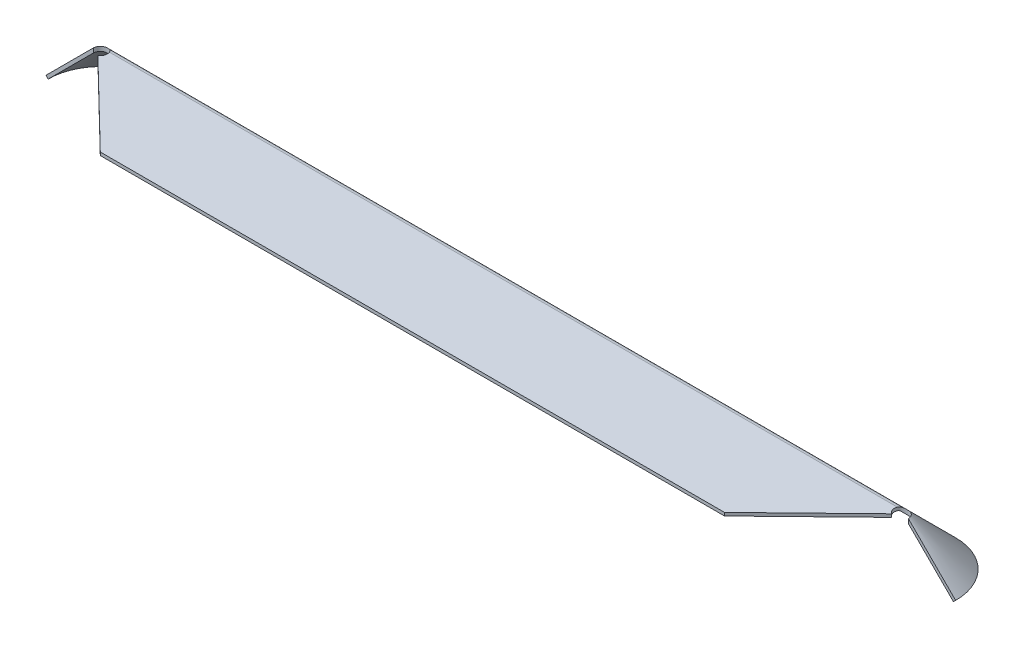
ISO-10303-21;
HEADER;
FILE_DESCRIPTION(('STEP AP214'),'2;1');
FILE_NAME('part.step','',(''),(''),'','','');
FILE_SCHEMA(('AUTOMOTIVE_DESIGN { 1 0 10303 214 1 1 1 1 }'));
ENDSEC;
DATA;
#1=APPLICATION_CONTEXT('core data for automotive mechanical design processes');
#2=APPLICATION_PROTOCOL_DEFINITION('international standard','automotive_design',2000,#1);
#3=PRODUCT_CONTEXT('',#1,'mechanical');
#4=PRODUCT('Part','Part','',(#3));
#5=PRODUCT_RELATED_PRODUCT_CATEGORY('part','',(#4));
#6=PRODUCT_DEFINITION_FORMATION('','',#4);
#7=PRODUCT_DEFINITION_CONTEXT('part definition',#1,'design');
#8=PRODUCT_DEFINITION('design','',#6,#7);
#9=PRODUCT_DEFINITION_SHAPE('','',#8);
#10=(LENGTH_UNIT() NAMED_UNIT(*) SI_UNIT(.MILLI.,.METRE.));
#11=(NAMED_UNIT(*) PLANE_ANGLE_UNIT() SI_UNIT($,.RADIAN.));
#12=(NAMED_UNIT(*) SI_UNIT($,.STERADIAN.) SOLID_ANGLE_UNIT());
#13=UNCERTAINTY_MEASURE_WITH_UNIT(LENGTH_MEASURE(1.E-05),#10,'distance_accuracy_value','');
#14=(GEOMETRIC_REPRESENTATION_CONTEXT(3) GLOBAL_UNCERTAINTY_ASSIGNED_CONTEXT((#13)) GLOBAL_UNIT_ASSIGNED_CONTEXT((#10,
#11,#12)) REPRESENTATION_CONTEXT('',''));
#15=CARTESIAN_POINT('',(0.,0.,0.));
#16=DIRECTION('',(0.,0.,1.));
#17=DIRECTION('',(1.,0.,0.));
#18=AXIS2_PLACEMENT_3D('',#15,#16,#17);
#19=CARTESIAN_POINT('',(-154.,-1.2,-34.));
#20=DIRECTION('',(0.,1.,0.));
#21=DIRECTION('',(0.,0.,1.));
#22=AXIS2_PLACEMENT_3D('',#19,#20,#21);
#23=PLANE('',#22);
#24=CARTESIAN_POINT('',(154.,-1.19999999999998,-34.));
#25=DIRECTION('',(0.,1.,0.));
#26=DIRECTION('',(0.,0.,1.));
#27=AXIS2_PLACEMENT_3D('',#24,#25,#26);
#28=CIRCLE('',#27,2.69705627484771);
#29=CARTESIAN_POINT('',(151.49518213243,-1.2,-35.));
#30=VERTEX_POINT('',#29);
#31=CARTESIAN_POINT('',(152.616642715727,-1.19999999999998,-31.684738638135));
#32=VERTEX_POINT('',#31);
#33=EDGE_CURVE('E173',#30,#32,#28,.T.);
#34=ORIENTED_EDGE('',*,*,#33,.T.);
#35=DIRECTION('',(-0.717279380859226,0.,0.696785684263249));
#36=VECTOR('',#35,1.);
#37=CARTESIAN_POINT('',(-3.97732045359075,-1.2,120.435111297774));
#38=LINE('',#37,#36);
#39=CARTESIAN_POINT('',(120.,-1.19999999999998,0.));
#40=VERTEX_POINT('',#39);
#41=EDGE_CURVE('E175',#32,#40,#38,.T.);
#42=ORIENTED_EDGE('',*,*,#41,.T.);
#43=DIRECTION('',(1.,0.,0.));
#44=VECTOR('',#43,1.);
#45=CARTESIAN_POINT('',(0.,-1.2,0.));
#46=LINE('',#45,#44);
#47=CARTESIAN_POINT('',(-120.,-1.2,0.));
#48=VERTEX_POINT('',#47);
#49=EDGE_CURVE('E273',#48,#40,#46,.T.);
#50=ORIENTED_EDGE('',*,*,#49,.F.);
#51=DIRECTION('',(0.717279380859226,0.,0.696785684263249));
#52=VECTOR('',#51,1.);
#53=CARTESIAN_POINT('',(-154.485510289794,-1.2,-33.5002099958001));
#54=LINE('',#53,#52);
#55=CARTESIAN_POINT('',(-152.616642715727,-1.19999999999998,-31.684738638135));
#56=VERTEX_POINT('',#55);
#57=EDGE_CURVE('E55',#56,#48,#54,.T.);
#58=ORIENTED_EDGE('',*,*,#57,.F.);
#59=CARTESIAN_POINT('',(-154.,-1.19999999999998,-34.));
#60=DIRECTION('',(0.,1.,0.));
#61=DIRECTION('',(0.,0.,1.));
#62=AXIS2_PLACEMENT_3D('',#59,#60,#61);
#63=CIRCLE('',#62,2.69705627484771);
#64=CARTESIAN_POINT('',(-151.495182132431,-1.2,-35.));
#65=VERTEX_POINT('',#64);
#66=EDGE_CURVE('E226',#65,#56,#63,.F.);
#67=ORIENTED_EDGE('',*,*,#66,.F.);
#68=DIRECTION('',(-1.,0.,0.));
#69=VECTOR('',#68,1.);
#70=CARTESIAN_POINT('',(154.,-1.2,-35.));
#71=LINE('',#70,#69);
#72=EDGE_CURVE('E279',#30,#65,#71,.T.);
#73=ORIENTED_EDGE('',*,*,#72,.F.);
#74=EDGE_LOOP('',(#34,#42,#50,#58,#67,#73));
#75=FACE_BOUND('',#74,.T.);
#76=ADVANCED_FACE('F40',(#75),#23,.F.);
#77=CARTESIAN_POINT('',(-154.,0.,-34.));
#78=DIRECTION('',(0.,1.,0.));
#79=DIRECTION('',(0.,0.,1.));
#80=AXIS2_PLACEMENT_3D('',#77,#78,#79);
#81=PLANE('',#80);
#82=DIRECTION('',(-0.717279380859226,0.,0.696785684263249));
#83=VECTOR('',#82,1.);
#84=CARTESIAN_POINT('',(-3.97732045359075,0.,120.435111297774));
#85=LINE('',#84,#83);
#86=CARTESIAN_POINT('',(152.616642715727,0.,-31.684738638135));
#87=VERTEX_POINT('',#86);
#88=CARTESIAN_POINT('',(120.,0.,0.));
#89=VERTEX_POINT('',#88);
#90=EDGE_CURVE('E172',#87,#89,#85,.T.);
#91=ORIENTED_EDGE('',*,*,#90,.F.);
#92=CARTESIAN_POINT('',(154.,0.,-34.));
#93=DIRECTION('',(0.,1.,0.));
#94=DIRECTION('',(0.,0.,1.));
#95=AXIS2_PLACEMENT_3D('',#92,#93,#94);
#96=CIRCLE('',#95,2.69705627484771);
#97=CARTESIAN_POINT('',(151.49518213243,0.,-35.));
#98=VERTEX_POINT('',#97);
#99=EDGE_CURVE('E157',#98,#87,#96,.T.);
#100=ORIENTED_EDGE('',*,*,#99,.F.);
#101=DIRECTION('',(-1.,0.,0.));
#102=VECTOR('',#101,1.);
#103=CARTESIAN_POINT('',(154.,0.,-35.));
#104=LINE('',#103,#102);
#105=CARTESIAN_POINT('',(-151.495182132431,0.,-35.));
#106=VERTEX_POINT('',#105);
#107=EDGE_CURVE('E270',#98,#106,#104,.T.);
#108=ORIENTED_EDGE('',*,*,#107,.T.);
#109=CARTESIAN_POINT('',(-154.,0.,-34.));
#110=DIRECTION('',(0.,1.,0.));
#111=DIRECTION('',(0.,0.,1.));
#112=AXIS2_PLACEMENT_3D('',#109,#110,#111);
#113=CIRCLE('',#112,2.69705627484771);
#114=CARTESIAN_POINT('',(-152.616642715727,0.,-31.684738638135));
#115=VERTEX_POINT('',#114);
#116=EDGE_CURVE('E62',#106,#115,#113,.F.);
#117=ORIENTED_EDGE('',*,*,#116,.T.);
#118=DIRECTION('',(0.717279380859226,0.,0.696785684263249));
#119=VECTOR('',#118,1.);
#120=CARTESIAN_POINT('',(-154.485510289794,0.,-33.5002099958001));
#121=LINE('',#120,#119);
#122=CARTESIAN_POINT('',(-120.,0.,0.));
#123=VERTEX_POINT('',#122);
#124=EDGE_CURVE('E12',#115,#123,#121,.T.);
#125=ORIENTED_EDGE('',*,*,#124,.T.);
#126=DIRECTION('',(1.,0.,0.));
#127=VECTOR('',#126,1.);
#128=CARTESIAN_POINT('',(0.,0.,0.));
#129=LINE('',#128,#127);
#130=EDGE_CURVE('E267',#123,#89,#129,.T.);
#131=ORIENTED_EDGE('',*,*,#130,.T.);
#132=EDGE_LOOP('',(#91,#100,#108,#117,#125,#131));
#133=FACE_BOUND('',#132,.T.);
#134=ADVANCED_FACE('F265',(#133),#81,.T.);
#135=CARTESIAN_POINT('',(-154.,-0.848528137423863,-35.1455844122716));
#136=DIRECTION('',(0.,-0.707106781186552,0.707106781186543));
#137=DIRECTION('',(0.,-0.707106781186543,-0.707106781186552));
#138=AXIS2_PLACEMENT_3D('',#135,#136,#137);
#139=PLANE('',#138);
#140=CARTESIAN_POINT('',(154.,0.297056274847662,-34.));
#141=DIRECTION('',(0.,-0.707106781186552,0.707106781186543));
#142=DIRECTION('',(0.,-0.707106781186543,-0.707106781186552));
#143=AXIS2_PLACEMENT_3D('',#140,#141,#142);
#144=ELLIPSE('',#143,3.81421356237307,2.69705627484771);
#145=CARTESIAN_POINT('',(152.036061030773,-1.55147186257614,-35.8485281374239));
#146=VERTEX_POINT('',#145);
#147=CARTESIAN_POINT('',(154.,-2.39999999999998,-36.6970562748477));
#148=VERTEX_POINT('',#147);
#149=EDGE_CURVE('E153',#146,#148,#144,.T.);
#150=ORIENTED_EDGE('',*,*,#149,.F.);
#151=DIRECTION('',(1.,0.,0.));
#152=VECTOR('',#151,1.);
#153=CARTESIAN_POINT('',(-154.,-1.55147186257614,-35.8485281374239));
#154=LINE('',#153,#152);
#155=CARTESIAN_POINT('',(-152.036061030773,-1.55147186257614,-35.8485281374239));
#156=VERTEX_POINT('',#155);
#157=EDGE_CURVE('E325',#156,#146,#154,.T.);
#158=ORIENTED_EDGE('',*,*,#157,.F.);
#159=CARTESIAN_POINT('',(-154.,0.297056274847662,-34.));
#160=DIRECTION('',(0.,-0.707106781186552,0.707106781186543));
#161=DIRECTION('',(0.,-0.707106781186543,-0.707106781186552));
#162=AXIS2_PLACEMENT_3D('',#159,#160,#161);
#163=ELLIPSE('',#162,3.81421356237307,2.69705627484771);
#164=CARTESIAN_POINT('',(-154.,-2.39999999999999,-36.6970562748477));
#165=VERTEX_POINT('',#164);
#166=EDGE_CURVE('E227',#156,#165,#163,.F.);
#167=ORIENTED_EDGE('',*,*,#166,.T.);
#168=DIRECTION('',(0.,-0.707106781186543,-0.707106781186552));
#169=VECTOR('',#168,1.);
#170=CARTESIAN_POINT('',(-154.,-0.848528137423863,-35.1455844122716));
#171=LINE('',#170,#169);
#172=CARTESIAN_POINT('',(-154.,-19.7261976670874,-54.0232539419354));
#173=VERTEX_POINT('',#172);
#174=EDGE_CURVE('E298',#165,#173,#171,.T.);
#175=ORIENTED_EDGE('',*,*,#174,.T.);
#176=DIRECTION('',(1.,0.,0.));
#177=VECTOR('',#176,1.);
#178=CARTESIAN_POINT('',(-154.,-19.7261976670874,-54.0232539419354));
#179=LINE('',#178,#177);
#180=CARTESIAN_POINT('',(154.,-19.7261976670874,-54.0232539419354));
#181=VERTEX_POINT('',#180);
#182=EDGE_CURVE('E326',#173,#181,#179,.T.);
#183=ORIENTED_EDGE('',*,*,#182,.T.);
#184=DIRECTION('',(0.,-0.707106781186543,-0.707106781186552));
#185=VECTOR('',#184,1.);
#186=CARTESIAN_POINT('',(154.,-1.55147186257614,-35.8485281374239));
#187=LINE('',#186,#185);
#188=EDGE_CURVE('E329',#148,#181,#187,.T.);
#189=ORIENTED_EDGE('',*,*,#188,.F.);
#190=EDGE_LOOP('',(#150,#158,#167,#175,#183,#189));
#191=FACE_BOUND('',#190,.T.);
#192=ADVANCED_FACE('F234',(#191),#139,.T.);
#193=CARTESIAN_POINT('',(-154.,-2.4,-35.));
#194=DIRECTION('',(1.,0.,0.));
#195=DIRECTION('',(0.,0.,-1.));
#196=AXIS2_PLACEMENT_3D('',#193,#194,#195);
#197=CYLINDRICAL_SURFACE('',#196,1.2);
#198=CARTESIAN_POINT('',(151.49518213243,-1.2,-35.));
#199=CARTESIAN_POINT('',(151.509818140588,-1.19999967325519,-35.0366733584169));
#200=CARTESIAN_POINT('',(151.525256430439,-1.20168121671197,-35.0729900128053));
#201=CARTESIAN_POINT('',(151.557573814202,-1.20820658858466,-35.1446420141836));
#202=CARTESIAN_POINT('',(151.574451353,-1.21304704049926,-35.1799783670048));
#203=CARTESIAN_POINT('',(151.626852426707,-1.23194063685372,-35.2838461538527));
#204=CARTESIAN_POINT('',(151.664310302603,-1.25037062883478,-35.3506485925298));
#205=CARTESIAN_POINT('',(151.742678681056,-1.29718548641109,-35.4779022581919));
#206=CARTESIAN_POINT('',(151.783573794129,-1.32552760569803,-35.5383793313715));
#207=CARTESIAN_POINT('',(151.86754067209,-1.39094543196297,-35.6528030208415));
#208=CARTESIAN_POINT('',(151.910613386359,-1.42802497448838,-35.7067467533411));
#209=CARTESIAN_POINT('',(151.967610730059,-1.48200821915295,-35.773119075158));
#210=CARTESIAN_POINT('',(151.981327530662,-1.49537119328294,-35.7887133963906));
#211=CARTESIAN_POINT('',(152.008725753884,-1.52285130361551,-35.8191637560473));
#212=CARTESIAN_POINT('',(152.022407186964,-1.5369666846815,-35.8340213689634));
#213=CARTESIAN_POINT('',(152.036061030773,-1.55147186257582,-35.848528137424));
#214=B_SPLINE_CURVE_WITH_KNOTS('',3,(#198,#199,#200,#201,#202,#203,#204,#205,#206,#207,#208,
#209,#210,#211,#212,#213),.UNSPECIFIED.,.F.,.F.,(4,2,2,2,2,2,2,4),(0.,0.118354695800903,
0.236583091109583,0.47172552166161,0.705866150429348,0.940109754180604,1.01418352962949,
1.0880914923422),.UNSPECIFIED.);
#215=EDGE_CURVE('E178',#30,#146,#214,.T.);
#216=ORIENTED_EDGE('',*,*,#215,.F.);
#217=ORIENTED_EDGE('',*,*,#72,.T.);
#218=CARTESIAN_POINT('',(-151.495182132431,-1.2,-35.));
#219=CARTESIAN_POINT('',(-151.509818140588,-1.19999967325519,-35.0366733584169));
#220=CARTESIAN_POINT('',(-151.525256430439,-1.20168121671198,-35.0729900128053));
#221=CARTESIAN_POINT('',(-151.557573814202,-1.20820658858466,-35.1446420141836));
#222=CARTESIAN_POINT('',(-151.574451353,-1.21304704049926,-35.1799783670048));
#223=CARTESIAN_POINT('',(-151.626852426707,-1.23194063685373,-35.2838461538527));
#224=CARTESIAN_POINT('',(-151.664310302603,-1.25037062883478,-35.3506485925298));
#225=CARTESIAN_POINT('',(-151.742678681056,-1.2971854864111,-35.4779022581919));
#226=CARTESIAN_POINT('',(-151.783573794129,-1.32552760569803,-35.5383793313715));
#227=CARTESIAN_POINT('',(-151.86754067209,-1.39094543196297,-35.6528030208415));
#228=CARTESIAN_POINT('',(-151.910613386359,-1.42802497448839,-35.7067467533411));
#229=CARTESIAN_POINT('',(-151.967610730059,-1.48200821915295,-35.773119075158));
#230=CARTESIAN_POINT('',(-151.981327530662,-1.49537119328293,-35.7887133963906));
#231=CARTESIAN_POINT('',(-152.008725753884,-1.5228513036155,-35.8191637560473));
#232=CARTESIAN_POINT('',(-152.022407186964,-1.53696668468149,-35.8340213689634));
#233=CARTESIAN_POINT('',(-152.036061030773,-1.55147186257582,-35.848528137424));
#234=B_SPLINE_CURVE_WITH_KNOTS('',3,(#218,#219,#220,#221,#222,#223,#224,#225,#226,#227,#228,
#229,#230,#231,#232,#233),.UNSPECIFIED.,.F.,.F.,(4,2,2,2,2,2,2,4),(0.,0.118354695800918,
0.23658309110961,0.471725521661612,0.705866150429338,0.940109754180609,1.01418352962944,
1.0880914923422),.UNSPECIFIED.);
#235=EDGE_CURVE('E218',#65,#156,#234,.T.);
#236=ORIENTED_EDGE('',*,*,#235,.T.);
#237=ORIENTED_EDGE('',*,*,#157,.T.);
#238=EDGE_LOOP('',(#216,#217,#236,#237));
#239=FACE_BOUND('',#238,.T.);
#240=ADVANCED_FACE('F229',(#239),#197,.F.);
#241=CARTESIAN_POINT('',(-154.,-1.55147186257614,-34.));
#242=DIRECTION('',(0.,-1.,0.));
#243=DIRECTION('',(0.,0.,-1.));
#244=AXIS2_PLACEMENT_3D('',#241,#242,#243);
#245=CONICAL_SURFACE('',#244,1.84852813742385,0.785398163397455);
#246=ORIENTED_EDGE('',*,*,#174,.F.);
#247=CARTESIAN_POINT('',(-154.,-2.39999999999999,-34.));
#248=DIRECTION('',(0.,-1.,0.));
#249=DIRECTION('',(0.,0.,-1.));
#250=AXIS2_PLACEMENT_3D('',#247,#248,#249);
#251=CIRCLE('',#250,2.69705627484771);
#252=CARTESIAN_POINT('',(-156.697056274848,-2.39999999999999,-34.));
#253=VERTEX_POINT('',#252);
#254=EDGE_CURVE('E387',#165,#253,#251,.F.);
#255=ORIENTED_EDGE('',*,*,#254,.T.);
#256=DIRECTION('',(-0.707106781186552,-0.707106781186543,0.));
#257=VECTOR('',#256,1.);
#258=CARTESIAN_POINT('',(-155.145584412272,-0.848528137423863,-34.));
#259=LINE('',#258,#257);
#260=CARTESIAN_POINT('',(-174.023253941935,-19.7261976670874,-34.));
#261=VERTEX_POINT('',#260);
#262=EDGE_CURVE('E190',#253,#261,#259,.T.);
#263=ORIENTED_EDGE('',*,*,#262,.T.);
#264=CARTESIAN_POINT('',(-154.,-19.7261976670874,-34.));
#265=DIRECTION('',(0.,-1.,0.));
#266=DIRECTION('',(0.,0.,-1.));
#267=AXIS2_PLACEMENT_3D('',#264,#265,#266);
#268=CIRCLE('',#267,20.0232539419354);
#269=EDGE_CURVE('E322',#261,#173,#268,.T.);
#270=ORIENTED_EDGE('',*,*,#269,.T.);
#271=EDGE_LOOP('',(#246,#255,#263,#270));
#272=FACE_BOUND('',#271,.T.);
#273=ADVANCED_FACE('F233',(#272),#245,.F.);
#274=CARTESIAN_POINT('',(-154.,-2.4,-35.));
#275=DIRECTION('',(1.,0.,0.));
#276=DIRECTION('',(0.,0.,-1.));
#277=AXIS2_PLACEMENT_3D('',#274,#275,#276);
#278=CYLINDRICAL_SURFACE('',#277,2.4);
#279=ORIENTED_EDGE('',*,*,#107,.F.);
#280=CARTESIAN_POINT('',(151.49518213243,0.,-35.));
#281=CARTESIAN_POINT('',(151.519553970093,1.09403043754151E-05,-35.061088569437));
#282=CARTESIAN_POINT('',(151.546173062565,-0.00233142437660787,-35.1212362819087));
#283=CARTESIAN_POINT('',(151.603542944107,-0.0112130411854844,-35.2391017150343));
#284=CARTESIAN_POINT('',(151.634287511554,-0.0177460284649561,-35.2968229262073));
#285=CARTESIAN_POINT('',(151.699279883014,-0.0344148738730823,-35.4088853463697));
#286=CARTESIAN_POINT('',(151.733487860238,-0.0445124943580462,-35.4632554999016));
#287=CARTESIAN_POINT('',(151.805346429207,-0.0677918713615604,-35.5689797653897));
#288=CARTESIAN_POINT('',(151.842998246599,-0.0809747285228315,-35.6203327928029));
#289=CARTESIAN_POINT('',(151.960186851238,-0.124185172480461,-35.7689279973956));
#290=CARTESIAN_POINT('',(152.044395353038,-0.157999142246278,-35.8614541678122));
#291=CARTESIAN_POINT('',(152.223574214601,-0.231756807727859,-36.0332088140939));
#292=CARTESIAN_POINT('',(152.318590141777,-0.271726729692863,-36.1123772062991));
#293=CARTESIAN_POINT('',(152.53656601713,-0.361310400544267,-36.2701937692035));
#294=CARTESIAN_POINT('',(152.661437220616,-0.411335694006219,-36.3460096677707));
#295=CARTESIAN_POINT('',(152.857357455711,-0.48267832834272,-36.4441328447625));
#296=CARTESIAN_POINT('',(152.92397606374,-0.505806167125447,-36.4742015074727));
#297=CARTESIAN_POINT('',(153.060110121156,-0.549801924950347,-36.5290516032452));
#298=CARTESIAN_POINT('',(153.129625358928,-0.570670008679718,-36.5538334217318));
#299=CARTESIAN_POINT('',(153.263429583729,-0.606822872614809,-36.5953651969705));
#300=CARTESIAN_POINT('',(153.327437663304,-0.622470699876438,-36.612702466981));
#301=CARTESIAN_POINT('',(153.457270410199,-0.650179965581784,-36.6427247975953));
#302=CARTESIAN_POINT('',(153.523093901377,-0.662243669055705,-36.6554127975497));
#303=CARTESIAN_POINT('',(153.656939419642,-0.682094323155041,-36.6760133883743));
#304=CARTESIAN_POINT('',(153.724978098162,-0.689830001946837,-36.6838688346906));
#305=CARTESIAN_POINT('',(153.861995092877,-0.70029507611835,-36.6944077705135));
#306=CARTESIAN_POINT('',(153.930975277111,-0.703012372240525,-36.6970787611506));
#307=CARTESIAN_POINT('',(154.,-0.702943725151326,-36.6970562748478));
#308=B_SPLINE_CURVE_WITH_KNOTS('',3,(#280,#281,#282,#283,#284,#285,#286,#287,#288,#289,#290,
#291,#292,#293,#294,#295,#296,#297,#298,#299,#300,#301,#302,#303,#304,#305,#306,#307),
.UNSPECIFIED.,.F.,.F.,(4,2,2,2,2,2,2,2,2,2,2,2,2,4),(0.,0.197165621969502,0.39403717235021,
0.588858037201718,0.78374850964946,1.17093287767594,1.559814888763,2.02098484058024,
2.25076928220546,2.48053696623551,2.68469889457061,2.88873152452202,3.09513264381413,
3.30203074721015),.UNSPECIFIED.);
#309=CARTESIAN_POINT('',(154.,-0.702943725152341,-36.6970562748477));
#310=VERTEX_POINT('',#309);
#311=EDGE_CURVE('E249',#98,#310,#308,.T.);
#312=ORIENTED_EDGE('',*,*,#311,.T.);
#313=DIRECTION('',(1.,0.,0.));
#314=VECTOR('',#313,1.);
#315=CARTESIAN_POINT('',(-154.,-0.702943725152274,-36.6970562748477));
#316=LINE('',#315,#314);
#317=CARTESIAN_POINT('',(-154.,-0.702943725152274,-36.6970562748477));
#318=VERTEX_POINT('',#317);
#319=EDGE_CURVE('E307',#318,#310,#316,.T.);
#320=ORIENTED_EDGE('',*,*,#319,.F.);
#321=CARTESIAN_POINT('',(-151.495182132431,0.,-35.));
#322=CARTESIAN_POINT('',(-151.519553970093,1.0940304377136E-05,-35.061088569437));
#323=CARTESIAN_POINT('',(-151.546173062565,-0.00233142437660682,-35.1212362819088));
#324=CARTESIAN_POINT('',(-151.603542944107,-0.0112130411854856,-35.2391017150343));
#325=CARTESIAN_POINT('',(-151.634287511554,-0.0177460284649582,-35.2968229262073));
#326=CARTESIAN_POINT('',(-151.699279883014,-0.0344148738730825,-35.4088853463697));
#327=CARTESIAN_POINT('',(-151.733487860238,-0.0445124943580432,-35.4632554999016));
#328=CARTESIAN_POINT('',(-151.805346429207,-0.0677918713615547,-35.5689797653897));
#329=CARTESIAN_POINT('',(-151.842998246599,-0.0809747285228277,-35.6203327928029));
#330=CARTESIAN_POINT('',(-151.960186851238,-0.124185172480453,-35.7689279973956));
#331=CARTESIAN_POINT('',(-152.044395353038,-0.157999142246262,-35.8614541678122));
#332=CARTESIAN_POINT('',(-152.223574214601,-0.231756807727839,-36.0332088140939));
#333=CARTESIAN_POINT('',(-152.318590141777,-0.27172672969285,-36.1123772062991));
#334=CARTESIAN_POINT('',(-152.53656601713,-0.361310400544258,-36.2701937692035));
#335=CARTESIAN_POINT('',(-152.661437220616,-0.411335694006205,-36.3460096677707));
#336=CARTESIAN_POINT('',(-152.857357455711,-0.482678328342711,-36.4441328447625));
#337=CARTESIAN_POINT('',(-152.92397606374,-0.505806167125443,-36.4742015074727));
#338=CARTESIAN_POINT('',(-153.060110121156,-0.549801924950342,-36.5290516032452));
#339=CARTESIAN_POINT('',(-153.129625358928,-0.570670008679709,-36.5538334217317));
#340=CARTESIAN_POINT('',(-153.263429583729,-0.606822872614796,-36.5953651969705));
#341=CARTESIAN_POINT('',(-153.327437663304,-0.622470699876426,-36.612702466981));
#342=CARTESIAN_POINT('',(-153.457270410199,-0.650179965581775,-36.6427247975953));
#343=CARTESIAN_POINT('',(-153.523093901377,-0.662243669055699,-36.6554127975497));
#344=CARTESIAN_POINT('',(-153.656939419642,-0.682094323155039,-36.6760133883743));
#345=CARTESIAN_POINT('',(-153.724978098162,-0.689830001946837,-36.6838688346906));
#346=CARTESIAN_POINT('',(-153.861995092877,-0.700295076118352,-36.6944077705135));
#347=CARTESIAN_POINT('',(-153.930975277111,-0.703012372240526,-36.6970787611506));
#348=CARTESIAN_POINT('',(-154.,-0.702943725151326,-36.6970562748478));
#349=B_SPLINE_CURVE_WITH_KNOTS('',3,(#321,#322,#323,#324,#325,#326,#327,#328,#329,#330,#331,
#332,#333,#334,#335,#336,#337,#338,#339,#340,#341,#342,#343,#344,#345,#346,#347,#348),
.UNSPECIFIED.,.F.,.F.,(4,2,2,2,2,2,2,2,2,2,2,2,2,4),(0.,0.197165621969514,0.394037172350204,
0.588858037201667,0.783748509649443,1.17093287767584,1.55981488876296,2.0209848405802,
2.25076928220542,2.48053696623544,2.68469889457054,2.88873152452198,3.09513264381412,
3.30203074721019),.UNSPECIFIED.);
#350=EDGE_CURVE('E192',#106,#318,#349,.T.);
#351=ORIENTED_EDGE('',*,*,#350,.F.);
#352=EDGE_LOOP('',(#279,#312,#320,#351));
#353=FACE_BOUND('',#352,.T.);
#354=ADVANCED_FACE('F202',(#353),#278,.T.);
#355=CARTESIAN_POINT('',(0.,-1.2,0.));
#356=DIRECTION('',(0.,0.,1.));
#357=DIRECTION('',(1.,0.,0.));
#358=AXIS2_PLACEMENT_3D('',#355,#356,#357);
#359=PLANE('',#358);
#360=ORIENTED_EDGE('',*,*,#130,.F.);
#361=DIRECTION('',(0.,1.,0.));
#362=VECTOR('',#361,1.);
#363=CARTESIAN_POINT('',(-120.,-1.2,0.));
#364=LINE('',#363,#362);
#365=EDGE_CURVE('E282',#48,#123,#364,.T.);
#366=ORIENTED_EDGE('',*,*,#365,.F.);
#367=ORIENTED_EDGE('',*,*,#49,.T.);
#368=DIRECTION('',(0.,1.,0.));
#369=VECTOR('',#368,1.);
#370=CARTESIAN_POINT('',(120.,-1.2,0.));
#371=LINE('',#370,#369);
#372=EDGE_CURVE('E48',#40,#89,#371,.T.);
#373=ORIENTED_EDGE('',*,*,#372,.T.);
#374=EDGE_LOOP('',(#360,#366,#367,#373));
#375=FACE_BOUND('',#374,.T.);
#376=ADVANCED_FACE('F42',(#375),#359,.T.);
#377=CARTESIAN_POINT('',(-154.,-18.8776695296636,-34.));
#378=DIRECTION('',(0.,1.,0.));
#379=DIRECTION('',(0.,0.,1.));
#380=AXIS2_PLACEMENT_3D('',#377,#378,#379);
#381=CONICAL_SURFACE('',#380,20.8717820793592,0.785398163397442);
#382=DIRECTION('',(0.707106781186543,-0.707106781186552,0.));
#383=VECTOR('',#382,1.);
#384=CARTESIAN_POINT('',(-174.871782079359,-18.8776695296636,-34.));
#385=LINE('',#384,#383);
#386=CARTESIAN_POINT('',(-174.871782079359,-18.8776695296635,-34.));
#387=VERTEX_POINT('',#386);
#388=EDGE_CURVE('E271',#387,#261,#385,.T.);
#389=ORIENTED_EDGE('',*,*,#388,.F.);
#390=CARTESIAN_POINT('',(-154.,-18.8776695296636,-34.));
#391=DIRECTION('',(0.,-1.,0.));
#392=DIRECTION('',(-1.,0.,0.));
#393=AXIS2_PLACEMENT_3D('',#390,#391,#392);
#394=CIRCLE('',#393,20.8717820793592);
#395=CARTESIAN_POINT('',(-154.,-18.8776695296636,-54.8717820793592));
#396=VERTEX_POINT('',#395);
#397=EDGE_CURVE('E308',#387,#396,#394,.T.);
#398=ORIENTED_EDGE('',*,*,#397,.T.);
#399=DIRECTION('',(0.,-0.707106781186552,0.707106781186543));
#400=VECTOR('',#399,1.);
#401=CARTESIAN_POINT('',(-154.,-18.8776695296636,-54.8717820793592));
#402=LINE('',#401,#400);
#403=EDGE_CURVE('E276',#396,#173,#402,.T.);
#404=ORIENTED_EDGE('',*,*,#403,.T.);
#405=ORIENTED_EDGE('',*,*,#269,.F.);
#406=EDGE_LOOP('',(#389,#398,#404,#405));
#407=FACE_BOUND('',#406,.T.);
#408=ADVANCED_FACE('F350',(#407),#381,.T.);
#409=CARTESIAN_POINT('',(-154.,-18.8776695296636,-54.8717820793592));
#410=DIRECTION('',(0.,-0.707106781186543,-0.707106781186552));
#411=DIRECTION('',(1.,0.,0.));
#412=AXIS2_PLACEMENT_3D('',#409,#410,#411);
#413=PLANE('',#412);
#414=ORIENTED_EDGE('',*,*,#403,.F.);
#415=DIRECTION('',(1.,0.,0.));
#416=VECTOR('',#415,1.);
#417=CARTESIAN_POINT('',(-154.,-18.8776695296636,-54.8717820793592));
#418=LINE('',#417,#416);
#419=CARTESIAN_POINT('',(154.,-18.8776695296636,-54.8717820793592));
#420=VERTEX_POINT('',#419);
#421=EDGE_CURVE('E301',#396,#420,#418,.T.);
#422=ORIENTED_EDGE('',*,*,#421,.T.);
#423=DIRECTION('',(0.,-0.707106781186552,0.707106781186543));
#424=VECTOR('',#423,1.);
#425=CARTESIAN_POINT('',(154.,-18.8776695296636,-54.8717820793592));
#426=LINE('',#425,#424);
#427=EDGE_CURVE('E290',#420,#181,#426,.T.);
#428=ORIENTED_EDGE('',*,*,#427,.T.);
#429=ORIENTED_EDGE('',*,*,#182,.F.);
#430=EDGE_LOOP('',(#414,#422,#428,#429));
#431=FACE_BOUND('',#430,.T.);
#432=ADVANCED_FACE('F353',(#431),#413,.T.);
#433=CARTESIAN_POINT('',(154.,-18.8776695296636,-34.));
#434=DIRECTION('',(0.,1.,0.));
#435=DIRECTION('',(0.,0.,1.));
#436=AXIS2_PLACEMENT_3D('',#433,#434,#435);
#437=CONICAL_SURFACE('',#436,20.8717820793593,0.785398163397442);
#438=ORIENTED_EDGE('',*,*,#427,.F.);
#439=CARTESIAN_POINT('',(154.,-18.8776695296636,-34.));
#440=DIRECTION('',(0.,-1.,0.));
#441=DIRECTION('',(0.,0.,-1.));
#442=AXIS2_PLACEMENT_3D('',#439,#440,#441);
#443=CIRCLE('',#442,20.8717820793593);
#444=CARTESIAN_POINT('',(174.871782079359,-18.8776695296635,-34.));
#445=VERTEX_POINT('',#444);
#446=EDGE_CURVE('E295',#420,#445,#443,.T.);
#447=ORIENTED_EDGE('',*,*,#446,.T.);
#448=DIRECTION('',(-0.707106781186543,-0.707106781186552,0.));
#449=VECTOR('',#448,1.);
#450=CARTESIAN_POINT('',(174.871782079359,-18.8776695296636,-34.));
#451=LINE('',#450,#449);
#452=CARTESIAN_POINT('',(174.023253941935,-19.7261976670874,-34.));
#453=VERTEX_POINT('',#452);
#454=EDGE_CURVE('E293',#445,#453,#451,.T.);
#455=ORIENTED_EDGE('',*,*,#454,.T.);
#456=CARTESIAN_POINT('',(154.,-19.7261976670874,-34.));
#457=DIRECTION('',(0.,-1.,0.));
#458=DIRECTION('',(0.,0.,-1.));
#459=AXIS2_PLACEMENT_3D('',#456,#457,#458);
#460=CIRCLE('',#459,20.0232539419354);
#461=EDGE_CURVE('E171',#181,#453,#460,.T.);
#462=ORIENTED_EDGE('',*,*,#461,.F.);
#463=EDGE_LOOP('',(#438,#447,#455,#462));
#464=FACE_BOUND('',#463,.T.);
#465=ADVANCED_FACE('F357',(#464),#437,.T.);
#466=CARTESIAN_POINT('',(154.,-1.55147186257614,-34.));
#467=DIRECTION('',(0.,-1.,0.));
#468=DIRECTION('',(0.,0.,-1.));
#469=AXIS2_PLACEMENT_3D('',#466,#467,#468);
#470=CONICAL_SURFACE('',#469,1.84852813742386,0.785398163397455);
#471=CARTESIAN_POINT('',(154.,-2.39999999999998,-34.));
#472=DIRECTION('',(0.,-1.,0.));
#473=DIRECTION('',(0.,0.,-1.));
#474=AXIS2_PLACEMENT_3D('',#471,#472,#473);
#475=CIRCLE('',#474,2.69705627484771);
#476=CARTESIAN_POINT('',(156.697056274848,-2.39999999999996,-34.));
#477=VERTEX_POINT('',#476);
#478=EDGE_CURVE('E147',#148,#477,#475,.T.);
#479=ORIENTED_EDGE('',*,*,#478,.F.);
#480=ORIENTED_EDGE('',*,*,#188,.T.);
#481=ORIENTED_EDGE('',*,*,#461,.T.);
#482=DIRECTION('',(0.707106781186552,-0.707106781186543,0.));
#483=VECTOR('',#482,1.);
#484=CARTESIAN_POINT('',(154.,0.297056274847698,-34.));
#485=LINE('',#484,#483);
#486=EDGE_CURVE('E161',#477,#453,#485,.T.);
#487=ORIENTED_EDGE('',*,*,#486,.F.);
#488=EDGE_LOOP('',(#479,#480,#481,#487));
#489=FACE_BOUND('',#488,.T.);
#490=ADVANCED_FACE('F169',(#489),#470,.F.);
#491=CARTESIAN_POINT('',(154.,-0.702943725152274,-34.));
#492=DIRECTION('',(0.,-1.,0.));
#493=DIRECTION('',(0.,0.,-1.));
#494=AXIS2_PLACEMENT_3D('',#491,#492,#493);
#495=CONICAL_SURFACE('',#494,2.69705627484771,0.785398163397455);
#496=ORIENTED_EDGE('',*,*,#446,.F.);
#497=DIRECTION('',(0.,-0.707106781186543,-0.707106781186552));
#498=VECTOR('',#497,1.);
#499=CARTESIAN_POINT('',(154.,0.,-35.9941125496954));
#500=LINE('',#499,#498);
#501=EDGE_CURVE('E304',#310,#420,#500,.T.);
#502=ORIENTED_EDGE('',*,*,#501,.F.);
#503=CARTESIAN_POINT('',(154.,-0.702943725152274,-34.));
#504=DIRECTION('',(0.,-1.,0.));
#505=DIRECTION('',(0.,0.,-1.));
#506=AXIS2_PLACEMENT_3D('',#503,#504,#505);
#507=CIRCLE('',#506,2.69705627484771);
#508=CARTESIAN_POINT('',(156.697056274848,-0.702943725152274,-34.));
#509=VERTEX_POINT('',#508);
#510=EDGE_CURVE('E300',#310,#509,#507,.T.);
#511=ORIENTED_EDGE('',*,*,#510,.T.);
#512=DIRECTION('',(0.707106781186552,-0.707106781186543,0.));
#513=VECTOR('',#512,1.);
#514=CARTESIAN_POINT('',(155.994112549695,0.,-34.));
#515=LINE('',#514,#513);
#516=EDGE_CURVE('E164',#509,#445,#515,.T.);
#517=ORIENTED_EDGE('',*,*,#516,.T.);
#518=EDGE_LOOP('',(#496,#502,#511,#517));
#519=FACE_BOUND('',#518,.T.);
#520=ADVANCED_FACE('F362',(#519),#495,.T.);
#521=CARTESIAN_POINT('',(-154.,0.,-35.9941125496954));
#522=DIRECTION('',(0.,-0.707106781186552,0.707106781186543));
#523=DIRECTION('',(0.,-0.707106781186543,-0.707106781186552));
#524=AXIS2_PLACEMENT_3D('',#521,#522,#523);
#525=PLANE('',#524);
#526=ORIENTED_EDGE('',*,*,#421,.F.);
#527=DIRECTION('',(0.,-0.707106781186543,-0.707106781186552));
#528=VECTOR('',#527,1.);
#529=CARTESIAN_POINT('',(-154.,0.,-35.9941125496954));
#530=LINE('',#529,#528);
#531=EDGE_CURVE('E311',#318,#396,#530,.T.);
#532=ORIENTED_EDGE('',*,*,#531,.F.);
#533=ORIENTED_EDGE('',*,*,#319,.T.);
#534=ORIENTED_EDGE('',*,*,#501,.T.);
#535=EDGE_LOOP('',(#526,#532,#533,#534));
#536=FACE_BOUND('',#535,.T.);
#537=ADVANCED_FACE('F342',(#536),#525,.F.);
#538=CARTESIAN_POINT('',(-154.,-0.702943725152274,-34.));
#539=DIRECTION('',(0.,-1.,0.));
#540=DIRECTION('',(0.,0.,-1.));
#541=AXIS2_PLACEMENT_3D('',#538,#539,#540);
#542=CONICAL_SURFACE('',#541,2.6970562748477,0.785398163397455);
#543=ORIENTED_EDGE('',*,*,#397,.F.);
#544=DIRECTION('',(-0.707106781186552,-0.707106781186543,0.));
#545=VECTOR('',#544,1.);
#546=CARTESIAN_POINT('',(-155.994112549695,0.,-34.));
#547=LINE('',#546,#545);
#548=CARTESIAN_POINT('',(-156.697056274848,-0.702943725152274,-34.));
#549=VERTEX_POINT('',#548);
#550=EDGE_CURVE('E315',#549,#387,#547,.T.);
#551=ORIENTED_EDGE('',*,*,#550,.F.);
#552=CARTESIAN_POINT('',(-154.,-0.702943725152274,-34.));
#553=DIRECTION('',(0.,-1.,0.));
#554=DIRECTION('',(-1.,0.,0.));
#555=AXIS2_PLACEMENT_3D('',#552,#553,#554);
#556=CIRCLE('',#555,2.6970562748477);
#557=EDGE_CURVE('E314',#549,#318,#556,.T.);
#558=ORIENTED_EDGE('',*,*,#557,.T.);
#559=ORIENTED_EDGE('',*,*,#531,.T.);
#560=EDGE_LOOP('',(#543,#551,#558,#559));
#561=FACE_BOUND('',#560,.T.);
#562=ADVANCED_FACE('F338',(#561),#542,.T.);
#563=CARTESIAN_POINT('',(-120.,457.075920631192,0.));
#564=DIRECTION('',(-0.696785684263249,0.,0.717279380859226));
#565=DIRECTION('',(0.717279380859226,0.,0.696785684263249));
#566=AXIS2_PLACEMENT_3D('',#563,#564,#565);
#567=PLANE('',#566);
#568=DIRECTION('',(0.,-1.,0.));
#569=VECTOR('',#568,1.);
#570=CARTESIAN_POINT('',(-152.616642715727,457.075920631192,-31.684738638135));
#571=LINE('',#570,#569);
#572=EDGE_CURVE('E187',#115,#56,#571,.T.);
#573=ORIENTED_EDGE('',*,*,#572,.T.);
#574=ORIENTED_EDGE('',*,*,#57,.T.);
#575=ORIENTED_EDGE('',*,*,#365,.T.);
#576=ORIENTED_EDGE('',*,*,#124,.F.);
#577=EDGE_LOOP('',(#573,#574,#575,#576));
#578=FACE_BOUND('',#577,.T.);
#579=ADVANCED_FACE('F212',(#578),#567,.T.);
#580=CARTESIAN_POINT('',(-154.,457.075920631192,-34.));
#581=DIRECTION('',(0.,-1.,0.));
#582=DIRECTION('',(0.,0.,-1.));
#583=AXIS2_PLACEMENT_3D('',#580,#581,#582);
#584=CYLINDRICAL_SURFACE('',#583,2.69705627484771);
#585=ORIENTED_EDGE('',*,*,#235,.F.);
#586=ORIENTED_EDGE('',*,*,#66,.T.);
#587=ORIENTED_EDGE('',*,*,#572,.F.);
#588=ORIENTED_EDGE('',*,*,#116,.F.);
#589=ORIENTED_EDGE('',*,*,#350,.T.);
#590=ORIENTED_EDGE('',*,*,#557,.F.);
#591=DIRECTION('',(0.,-1.,0.));
#592=VECTOR('',#591,1.);
#593=CARTESIAN_POINT('',(-156.697056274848,457.075920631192,-34.));
#594=LINE('',#593,#592);
#595=EDGE_CURVE('E184',#549,#253,#594,.T.);
#596=ORIENTED_EDGE('',*,*,#595,.T.);
#597=ORIENTED_EDGE('',*,*,#254,.F.);
#598=ORIENTED_EDGE('',*,*,#166,.F.);
#599=EDGE_LOOP('',(#585,#586,#587,#588,#589,#590,#596,#597,#598));
#600=FACE_BOUND('',#599,.T.);
#601=ADVANCED_FACE('F206',(#600),#584,.F.);
#602=CARTESIAN_POINT('',(-156.697056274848,457.075920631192,-34.));
#603=DIRECTION('',(0.,0.,1.));
#604=DIRECTION('',(1.,0.,0.));
#605=AXIS2_PLACEMENT_3D('',#602,#603,#604);
#606=PLANE('',#605);
#607=ORIENTED_EDGE('',*,*,#262,.F.);
#608=ORIENTED_EDGE('',*,*,#595,.F.);
#609=ORIENTED_EDGE('',*,*,#550,.T.);
#610=ORIENTED_EDGE('',*,*,#388,.T.);
#611=EDGE_LOOP('',(#607,#608,#609,#610));
#612=FACE_BOUND('',#611,.T.);
#613=ADVANCED_FACE('F211',(#612),#606,.T.);
#614=CARTESIAN_POINT('',(120.,458.575920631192,0.));
#615=DIRECTION('',(-0.696785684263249,0.,-0.717279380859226));
#616=DIRECTION('',(-0.717279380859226,0.,0.696785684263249));
#617=AXIS2_PLACEMENT_3D('',#614,#615,#616);
#618=PLANE('',#617);
#619=ORIENTED_EDGE('',*,*,#41,.F.);
#620=DIRECTION('',(0.,-1.,0.));
#621=VECTOR('',#620,1.);
#622=CARTESIAN_POINT('',(152.616642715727,458.575920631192,-31.684738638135));
#623=LINE('',#622,#621);
#624=EDGE_CURVE('E166',#87,#32,#623,.T.);
#625=ORIENTED_EDGE('',*,*,#624,.F.);
#626=ORIENTED_EDGE('',*,*,#90,.T.);
#627=ORIENTED_EDGE('',*,*,#372,.F.);
#628=EDGE_LOOP('',(#619,#625,#626,#627));
#629=FACE_BOUND('',#628,.T.);
#630=ADVANCED_FACE('F246',(#629),#618,.F.);
#631=CARTESIAN_POINT('',(156.697056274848,458.575920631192,-34.));
#632=DIRECTION('',(0.,0.,-1.));
#633=DIRECTION('',(-1.,0.,0.));
#634=AXIS2_PLACEMENT_3D('',#631,#632,#633);
#635=PLANE('',#634);
#636=DIRECTION('',(0.,-1.,0.));
#637=VECTOR('',#636,1.);
#638=CARTESIAN_POINT('',(156.697056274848,458.575920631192,-34.));
#639=LINE('',#638,#637);
#640=EDGE_CURVE('E150',#509,#477,#639,.T.);
#641=ORIENTED_EDGE('',*,*,#640,.T.);
#642=ORIENTED_EDGE('',*,*,#486,.T.);
#643=ORIENTED_EDGE('',*,*,#454,.F.);
#644=ORIENTED_EDGE('',*,*,#516,.F.);
#645=EDGE_LOOP('',(#641,#642,#643,#644));
#646=FACE_BOUND('',#645,.T.);
#647=ADVANCED_FACE('F160',(#646),#635,.F.);
#648=CARTESIAN_POINT('',(154.,458.575920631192,-34.));
#649=DIRECTION('',(0.,-1.,0.));
#650=DIRECTION('',(0.,0.,-1.));
#651=AXIS2_PLACEMENT_3D('',#648,#649,#650);
#652=CYLINDRICAL_SURFACE('',#651,2.69705627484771);
#653=ORIENTED_EDGE('',*,*,#33,.F.);
#654=ORIENTED_EDGE('',*,*,#215,.T.);
#655=ORIENTED_EDGE('',*,*,#149,.T.);
#656=ORIENTED_EDGE('',*,*,#478,.T.);
#657=ORIENTED_EDGE('',*,*,#640,.F.);
#658=ORIENTED_EDGE('',*,*,#510,.F.);
#659=ORIENTED_EDGE('',*,*,#311,.F.);
#660=ORIENTED_EDGE('',*,*,#99,.T.);
#661=ORIENTED_EDGE('',*,*,#624,.T.);
#662=EDGE_LOOP('',(#653,#654,#655,#656,#657,#658,#659,#660,#661));
#663=FACE_BOUND('',#662,.T.);
#664=ADVANCED_FACE('F149',(#663),#652,.F.);
#665=CLOSED_SHELL('',(#76,#134,#192,#240,#273,#354,#376,#408,#432,#465,#490,#520,#537,#562,#579,
#601,#613,#630,#647,#664));
#666=MANIFOLD_SOLID_BREP('B2',#665);
#667=ADVANCED_BREP_SHAPE_REPRESENTATION('',(#18,#666),#14);
#668=SHAPE_DEFINITION_REPRESENTATION(#9,#667);
ENDSEC;
END-ISO-10303-21;
